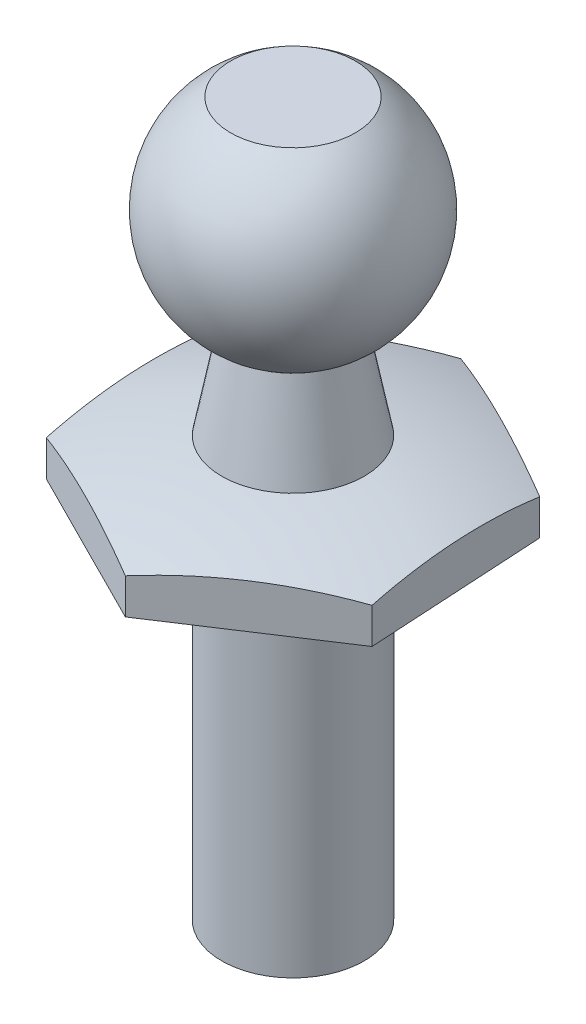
from build123d import *

# Parameters (mm, degrees)
ESQUISSE4_OUTSIDE_W     = 31.798
ESQUISSE4_OUTSIDE_H     = 31.798
ENL_V_MAT_EXTRU_4_DEPTH = 43.426406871


with BuildPart() as part:
    # Esquisse1 → Base-R_volution (revolve)
    with BuildSketch(Plane.XY, mode=Mode.PRIVATE) as base_r_volution_sk:
        with BuildLine():
            Line((0, -20), (4, -20))
            Line((4, -20), (4, 0))
            Line((4, 0), (10, 0))
            Line((10, 0), (10, 2))
            ThreePointArc((10, 2), (7.043290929, 2.946275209), (4, 3.55941926))
            Line((4, 3.55941926), (3, 8.756493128))
            ThreePointArc((3, 8.756493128), (6.493582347, 14.234004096), (3.5, 20))
            Line((3.5, 20), (0, 20))
            Line((0, 20), (0, -20))
        make_face()
    revolve(base_r_volution_sk.sketch.rotate(Axis((0, 14.522774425, 0), (0, -1, 0)), 26.717636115), axis=Axis((0, 14.522774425, 0), (0, -1, 0)))

    # Esquisse4 outside → Enl_v. mat.-Extru.4 (cut, through all)
    with BuildSketch(Plane.XZ.offset(20)):
        Rectangle(ESQUISSE4_OUTSIDE_W, ESQUISSE4_OUTSIDE_H)
        Polygon((8.932330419, 4.495939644), (0.572567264, 9.98359488), (-8.359763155, 5.487655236), (-8.932330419, -4.495939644), (-0.572567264, -9.98359488), (8.359763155, -5.487655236), align=None, mode=Mode.SUBTRACT)
    extrude(amount=-ENL_V_MAT_EXTRU_4_DEPTH, mode=Mode.SUBTRACT)


solid = part.part
